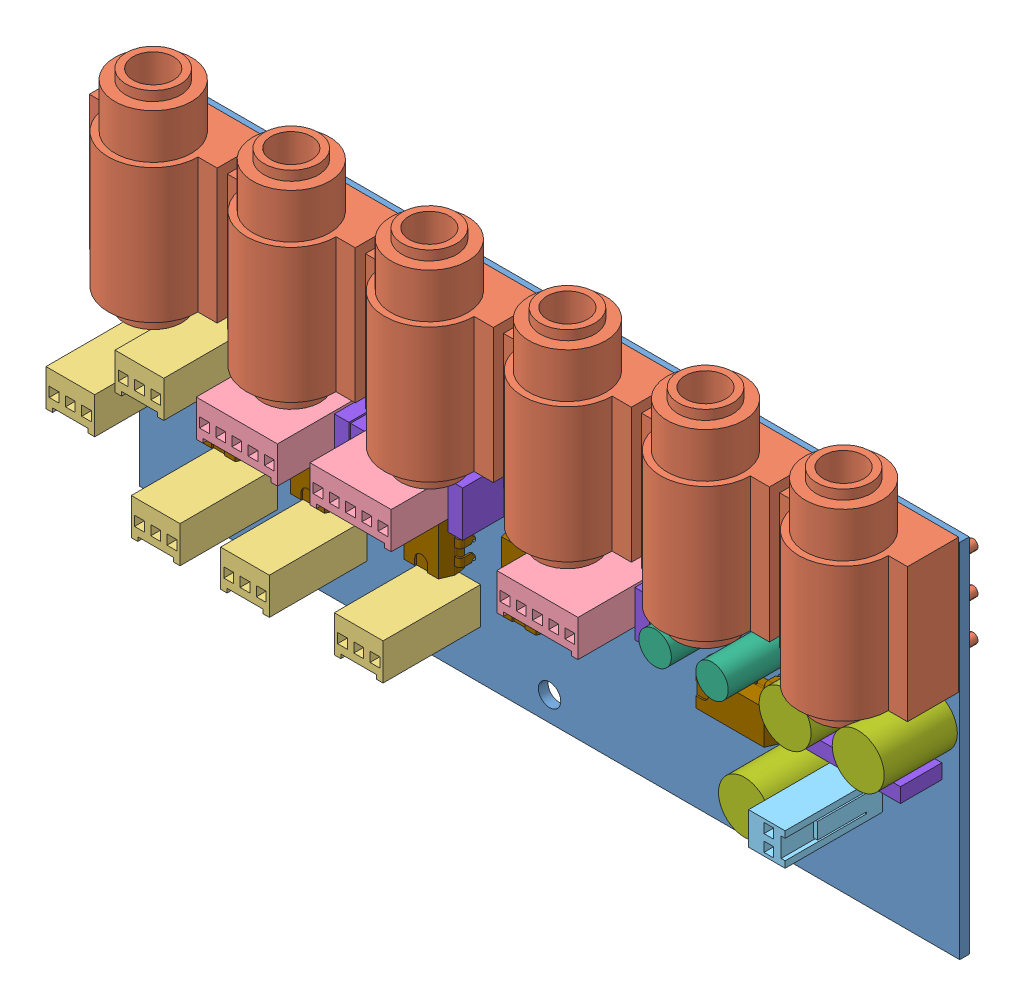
SolidWorks assembly Mix.SLDASM, configuration Default (file format 4400). Lengths in mm.
Overall size (128.27 65.65 19.24).
35 component instances, 9 part files, 107 mates.
Components (placement in the parent):
- Mixbrd-1: Mixbrd.SLDPRT [Default] at (-53.2181 34.2951 4.7829) size (128.27 56.52 1.5)
- nys216-1: nys216.SLDPRT [По умолчанию] at (-43.0581 34.9301 12.7829) x (1 0 0) z (0 1 0) size (20 19 32.5)
- nys216-2: nys216.SLDPRT [По умолчанию] at (-21.4681 34.9301 12.7829) x (1 0 0) z (0 1 0) size (20 19 32.5)
- nys216-3: nys216.SLDPRT [По умолчанию] at (0.1219 34.9301 12.7829) x (1 0 0) z (0 1 0) size (20 19 32.5)
- nys216-4: nys216.SLDPRT [По умолчанию] at (21.7119 34.9301 12.7829) x (1 0 0) z (0 1 0) size (20 19 32.5)
- nys216-5: nys216.SLDPRT [По умолчанию] at (43.3019 34.9301 12.7829) x (1 0 0) z (0 1 0) size (20 19 32.5)
- nys216-6: nys216.SLDPRT [По умолчанию] at (64.8919 34.9301 12.7829) x (1 0 0) z (0 1 0) size (20 19 32.5)
- WF3-1: WF3.SLDPRT [Default] at (-51.3131 -1.2649 4.7829) size (7.62 5.72 17.78)
- WF3-2: WF3.SLDPRT [Default] at (-37.9781 -12.0599 4.7829) size (7.62 5.72 17.78)
- WF3-3: WF3.SLDPRT [Default] at (-24.0081 -12.0599 4.7829) size (7.62 5.72 17.78)
- WF3-4: WF3.SLDPRT [Default] at (-6.2281 -12.0599 4.7829) size (7.62 5.72 17.78)
- WF5-1: WF5.SLDPRT [Default] at (-27.8181 6.3551 4.7829) size (12.7 5.72 17.78)
- WF5-2: WF5.SLDPRT [Default] at (-10.0381 6.3551 4.7829) size (12.7 5.72 17.78)
- WF5-3: WF5.SLDPRT [Default] at (19.1719 6.3551 4.7829) size (12.7 5.72 17.78)
- WF3-5: WF3.SLDPRT [Default] at (-40.5181 6.3551 4.7829) size (7.62 5.72 17.78)
- WF2-1: WF2.SLDPRT [Default] at (60.4469 -6.9799 4.7829) x (0 1 0) z (0 0 1) size (5.08 5.72 17.78)
- elco11_5X5-1: elco11_5X5.SLDPRT [По умолчанию] at (38.8569 7.6251 4.7829) x (0 -1 0) z (0 0 1) size (5.08 5.08 13.97)
- elco11_5X5-2: elco11_5X5.SLDPRT [По умолчанию] at (47.7469 7.6251 4.7829) x (0 -1 0) z (0 0 1) size (5.08 5.08 13.97)
- elco11_5X8_2-1: elco11_5X8_2.SLDPRT [По умолчанию] at (59.1769 8.2601 4.7829) size (8.13 8.13 13.97)
- elco11_5X8_2-2: elco11_5X8_2.SLDPRT [По умолчанию] at (70.6069 8.2601 4.7829) size (8.13 8.13 13.97)
- elco11_5X8_2-3: elco11_5X8_2.SLDPRT [По умолчанию] at (52.8269 -6.9799 4.7829) size (8.13 8.13 13.97)
- crm7_5X7_5X2_5X5-2: crm7_5X7_5X2_5X5.SLDPRT [Default] at (2.6619 5.7201 4.7829) x (0 -1 0) z (0 0 1) size (7.11 2.29 9.02)
- crm7_5X7_5X2_5X5-3: crm7_5X7_5X2_5X5.SLDPRT [Default] at (-43.0581 5.7201 4.7829) x (0 -1 0) z (0 0 1) size (7.11 2.29 9.02)
- crm7_5X7_5X2_5X5-4: crm7_5X7_5X2_5X5.SLDPRT [Default] at (-30.3581 5.7201 4.7829) x (0 -1 0) z (0 0 1) size (7.11 2.29 9.02)
- crm7_5X7_5X2_5X5-5: crm7_5X7_5X2_5X5.SLDPRT [Default] at (-15.1181 5.7201 4.7829) x (0 -1 0) z (0 0 1) size (7.11 2.29 9.02)
- crm7_5X7_5X2_5X5-6: crm7_5X7_5X2_5X5.SLDPRT [Default] at (-12.5781 5.7201 4.7829) x (0 -1 0) z (0 0 1) size (7.11 2.29 9.02)
- crm7_5X7_5X2_5X5-7: crm7_5X7_5X2_5X5.SLDPRT [Default] at (16.6319 5.7201 4.7829) x (0 -1 0) z (0 0 1) size (7.11 2.29 9.02)
- crm7_5X7_5X2_5X5-8: crm7_5X7_5X2_5X5.SLDPRT [Default] at (31.8719 5.7201 4.7829) x (0 -1 0) z (0 0 1) size (7.11 2.29 9.02)
- crm7_5X7_5X2_5X5-9: crm7_5X7_5X2_5X5.SLDPRT [Default] at (61.0819 1.9101 4.7829) x (-1 0 0) z (0 0 1) size (7.11 2.29 9.02)
- crm7_5X7_5X2_5X5-10: crm7_5X7_5X2_5X5.SLDPRT [Default] at (68.7019 1.9101 4.7829) x (-1 0 0) z (0 0 1) size (7.11 2.29 9.02)
- dip8-1: dip8.SLDPRT [Default] at (39.4919 -5.7099 4.7829) x (0 1 0) z (1 0 0) size (8.38 6.86 11.43)
- dip8-2: dip8.SLDPRT [Default] at (14.0919 -5.7099 4.7829) x (-1 0 0) z (0 1 0) size (8.38 6.86 11.43)
- dip8-3: dip8.SLDPRT [Default] at (-1.1481 -5.7099 4.7829) x (-1 0 0) z (0 1 0) size (8.38 6.86 11.43)
- dip8-4: dip8.SLDPRT [Default] at (-18.9281 -5.7099 4.7829) x (-1 0 0) z (0 1 0) size (8.38 6.86 11.43)
- dip8-5: dip8.SLDPRT [Default] at (-32.8981 -5.7099 4.7829) x (-1 0 0) z (0 1 0) size (8.38 6.86 11.43)
Mates (geometry in assembly coordinates):
- Concentric1: concentric anti-aligned: circle of Mixbrd-1; circle of nys216-1
- Concentric2: concentric anti-aligned: circle of Mixbrd-1; circle of nys216-1
- Coincident1: coincident anti-aligned: plane of Mixbrd-1 through (-53.2181 -22.2199 4.7829) normal (0 0 1); plane of nys216-1 through (-33.0581 13.9301 4.7829) normal (0 0 -1)
- Concentric3: concentric anti-aligned: circle of Mixbrd-1; circle of nys216-2
- Concentric4: concentric anti-aligned: circle of Mixbrd-1; circle of nys216-2
- Coincident2: coincident anti-aligned: plane of Mixbrd-1 through (-53.2181 -22.2199 4.7829) normal (0 0 1); plane of nys216-2 through (-11.4681 13.9301 4.7829) normal (0 0 -1)
- Concentric5: concentric anti-aligned: circle of Mixbrd-1; circle of nys216-3
- Concentric6: concentric anti-aligned: circle of Mixbrd-1; circle of nys216-3
- Coincident3: coincident anti-aligned: plane of Mixbrd-1 through (-53.2181 -22.2199 4.7829) normal (0 0 1); plane of nys216-3 through (10.1219 13.9301 4.7829) normal (0 0 -1)
- Concentric7: concentric anti-aligned: circle of Mixbrd-1; circle of nys216-4
- Concentric8: concentric anti-aligned: circle of Mixbrd-1; circle of nys216-4
- Coincident4: coincident anti-aligned: plane of Mixbrd-1 through (-53.2181 -22.2199 4.7829) normal (0 0 1); plane of nys216-4 through (31.7119 13.9301 4.7829) normal (0 0 -1)
- Concentric9: concentric anti-aligned: circle of Mixbrd-1; circle of nys216-5
- Concentric10: concentric anti-aligned: circle of Mixbrd-1; circle of nys216-5
- Coincident5: coincident anti-aligned: plane of Mixbrd-1 through (-53.2181 -22.2199 4.7829) normal (0 0 1); plane of nys216-5 through (53.3019 13.9301 4.7829) normal (0 0 -1)
- Concentric11: concentric anti-aligned: circle of Mixbrd-1; circle of nys216-6
- Concentric12: concentric anti-aligned: circle of Mixbrd-1; circle of nys216-6
- Coincident6: coincident anti-aligned: plane of Mixbrd-1 through (-53.2181 -22.2199 4.7829) normal (0 0 1); plane of nys216-6 through (74.8919 13.9301 4.7829) normal (0 0 -1)
- Concentric13: concentric anti-aligned: circle of Mixbrd-1; circle of WF3-1
- Concentric14: concentric anti-aligned: circle of Mixbrd-1; circle of WF3-1
- Coincident7: coincident anti-aligned: plane of Mixbrd-1 through (-53.2181 -22.2199 4.7829) normal (0 0 1); plane of WF3-1 through (-52.5831 -3.8049 4.7829) normal (0 0 -1)
- Concentric15: concentric anti-aligned: circle of Mixbrd-1; circle of WF3-2
- Concentric16: concentric anti-aligned: circle of Mixbrd-1; circle of WF3-2
- Coincident8: coincident anti-aligned: plane of Mixbrd-1 through (-53.2181 -22.2199 4.7829) normal (0 0 1); plane of WF3-2 through (-39.2481 -14.5999 4.7829) normal (0 0 -1)
- Concentric17: concentric anti-aligned: circle of Mixbrd-1; circle of WF3-3
- Concentric18: concentric anti-aligned: circle of Mixbrd-1; circle of WF3-3
- Coincident9: coincident anti-aligned: plane of Mixbrd-1 through (-53.2181 -22.2199 4.7829) normal (0 0 1); plane of WF3-3 through (-25.2781 -14.5999 4.7829) normal (0 0 -1)
- Concentric19: concentric anti-aligned: circle of Mixbrd-1; circle of WF3-4
- Concentric20: concentric anti-aligned: circle of Mixbrd-1; circle of WF3-4
- Coincident10: coincident anti-aligned: plane of Mixbrd-1 through (-53.2181 -22.2199 4.7829) normal (0 0 1); plane of WF3-4 through (-7.4981 -14.5999 4.7829) normal (0 0 -1)
- Concentric21: concentric anti-aligned: circle of Mixbrd-1; circle of WF5-1
- Concentric22: concentric anti-aligned: circle of Mixbrd-1; circle of WF5-1
- Coincident11: coincident anti-aligned: plane of Mixbrd-1 through (-53.2181 -22.2199 4.7829) normal (0 0 1); plane of WF5-1 through (-29.0881 3.8151 4.7829) normal (0 0 -1)
- Concentric23: concentric anti-aligned: circle of Mixbrd-1; circle of WF5-2
- Concentric24: concentric anti-aligned: circle of Mixbrd-1; circle of WF5-2
- Coincident12: coincident anti-aligned: plane of Mixbrd-1 through (-53.2181 -22.2199 4.7829) normal (0 0 1); plane of WF5-2 through (-11.3081 3.8151 4.7829) normal (0 0 -1)
- Concentric25: concentric anti-aligned: circle of Mixbrd-1; circle of WF5-3
- Concentric26: concentric anti-aligned: circle of Mixbrd-1; circle of WF5-3
- Coincident13: coincident anti-aligned: plane of Mixbrd-1 through (-53.2181 -22.2199 4.7829) normal (0 0 1); plane of WF5-3 through (17.9019 3.8151 4.7829) normal (0 0 -1)
- Concentric27: concentric anti-aligned: circle of Mixbrd-1; circle of WF3-5
- Concentric28: concentric anti-aligned: circle of Mixbrd-1; circle of WF3-5
- Coincident14: coincident anti-aligned: plane of Mixbrd-1 through (-53.2181 -22.2199 4.7829) normal (0 0 1); plane of WF3-5 through (-41.7881 3.8151 4.7829) normal (0 0 -1)
- Concentric29: concentric anti-aligned: circle of Mixbrd-1; circle of WF2-1
- Concentric30: concentric anti-aligned: circle of Mixbrd-1; circle of WF2-1
- Coincident15: coincident anti-aligned: plane of Mixbrd-1 through (-53.2181 -22.2199 4.7829) normal (0 0 1); plane of WF2-1 through (62.9869 -8.2499 4.7829) normal (0 0 -1)
- Concentric33: concentric anti-aligned: circle of Mixbrd-1; circle of elco11_5X5-1
- Concentric34: concentric anti-aligned: circle of Mixbrd-1; circle of elco11_5X5-1
- Coincident17: coincident anti-aligned: plane of Mixbrd-1 through (-53.2181 -22.2199 4.7829) normal (0 0 1); plane of elco11_5X5-1 through (38.8569 7.6251 4.7829) normal (0 0 -1)
- Concentric35: concentric anti-aligned: circle of Mixbrd-1; circle of elco11_5X5-2
- Concentric36: concentric anti-aligned: circle of Mixbrd-1; circle of elco11_5X5-2
- Coincident18: coincident anti-aligned: plane of Mixbrd-1 through (-53.2181 -22.2199 4.7829) normal (0 0 1); plane of elco11_5X5-2 through (47.7469 7.6251 4.7829) normal (0 0 -1)
- Concentric37: concentric anti-aligned: circle of Mixbrd-1; circle of elco11_5X8_2-1
- Concentric38: concentric anti-aligned: circle of Mixbrd-1; circle of elco11_5X8_2-1
- Coincident20: coincident anti-aligned: plane of Mixbrd-1 through (-53.2181 -22.2199 4.7829) normal (0 0 1); plane of elco11_5X8_2-1 through (59.1769 8.2601 4.7829) normal (0 0 -1)
- Concentric39: concentric anti-aligned: circle of Mixbrd-1; circle of elco11_5X8_2-2
- Concentric40: concentric anti-aligned: circle of Mixbrd-1; circle of elco11_5X8_2-2
- Coincident21: coincident anti-aligned: plane of Mixbrd-1 through (-53.2181 -22.2199 4.7829) normal (0 0 1); plane of elco11_5X8_2-2 through (70.6069 8.2601 4.7829) normal (0 0 -1)
- Concentric41: concentric anti-aligned: circle of Mixbrd-1; circle of elco11_5X8_2-3
- Concentric42: concentric anti-aligned: circle of Mixbrd-1; circle of elco11_5X8_2-3
- Coincident22: coincident anti-aligned: plane of Mixbrd-1 through (-53.2181 -22.2199 4.7829) normal (0 0 1); plane of elco11_5X8_2-3 through (52.8269 -6.9799 4.7829) normal (0 0 -1)
- Concentric47: concentric anti-aligned: circle of Mixbrd-1; circle of crm7_5X7_5X2_5X5-2
- Concentric48: concentric anti-aligned: circle of Mixbrd-1; circle of crm7_5X7_5X2_5X5-2
- Coincident23: coincident anti-aligned: plane of Mixbrd-1 through (-53.2181 -22.2199 4.7829) normal (0 0 1); plane of crm7_5X7_5X2_5X5-2 through (1.5189 9.2761 4.7829) normal (0 0 -1)
- Concentric49: concentric anti-aligned: circle of Mixbrd-1; circle of crm7_5X7_5X2_5X5-3
- Concentric50: concentric anti-aligned: circle of Mixbrd-1; circle of crm7_5X7_5X2_5X5-3
- Coincident24: coincident anti-aligned: plane of Mixbrd-1 through (-53.2181 -22.2199 4.7829) normal (0 0 1); plane of crm7_5X7_5X2_5X5-3 through (-44.2011 9.2761 4.7829) normal (0 0 -1)
- Concentric51: concentric anti-aligned: circle of Mixbrd-1; circle of crm7_5X7_5X2_5X5-4
- Concentric52: concentric anti-aligned: circle of Mixbrd-1; circle of crm7_5X7_5X2_5X5-4
- Coincident25: coincident anti-aligned: plane of Mixbrd-1 through (-53.2181 -22.2199 4.7829) normal (0 0 1); plane of crm7_5X7_5X2_5X5-4 through (-31.5011 9.2761 4.7829) normal (0 0 -1)
- Concentric53: concentric anti-aligned: circle of Mixbrd-1; circle of crm7_5X7_5X2_5X5-5
- Concentric54: concentric anti-aligned: circle of Mixbrd-1; circle of crm7_5X7_5X2_5X5-5
- Coincident26: coincident anti-aligned: plane of Mixbrd-1 through (-53.2181 -22.2199 4.7829) normal (0 0 1); plane of crm7_5X7_5X2_5X5-5 through (-16.2611 9.2761 4.7829) normal (0 0 -1)
- Concentric55: concentric anti-aligned: circle of Mixbrd-1; circle of crm7_5X7_5X2_5X5-6
- Concentric56: concentric anti-aligned: circle of Mixbrd-1; circle of crm7_5X7_5X2_5X5-6
- Coincident27: coincident anti-aligned: plane of Mixbrd-1 through (-53.2181 -22.2199 4.7829) normal (0 0 1); plane of crm7_5X7_5X2_5X5-6 through (-13.7211 9.2761 4.7829) normal (0 0 -1)
- Concentric57: concentric anti-aligned: circle of Mixbrd-1; circle of crm7_5X7_5X2_5X5-7
- Concentric58: concentric anti-aligned: circle of Mixbrd-1; circle of crm7_5X7_5X2_5X5-7
- Coincident28: coincident anti-aligned: plane of Mixbrd-1 through (-53.2181 -22.2199 4.7829) normal (0 0 1); plane of crm7_5X7_5X2_5X5-7 through (15.4889 9.2761 4.7829) normal (0 0 -1)
- Concentric59: concentric anti-aligned: circle of Mixbrd-1; circle of crm7_5X7_5X2_5X5-8
- Concentric60: concentric anti-aligned: circle of Mixbrd-1; circle of crm7_5X7_5X2_5X5-8
- Coincident29: coincident anti-aligned: plane of Mixbrd-1 through (-53.2181 -22.2199 4.7829) normal (0 0 1); plane of crm7_5X7_5X2_5X5-8 through (30.7289 9.2761 4.7829) normal (0 0 -1)
- Concentric61: concentric anti-aligned: circle of Mixbrd-1; circle of crm7_5X7_5X2_5X5-9
- Concentric62: concentric anti-aligned: circle of Mixbrd-1; circle of crm7_5X7_5X2_5X5-9
- Coincident30: coincident anti-aligned: plane of Mixbrd-1 through (-53.2181 -22.2199 4.7829) normal (0 0 1); plane of crm7_5X7_5X2_5X5-9 through (64.6379 3.0531 4.7829) normal (0 0 -1)
- Concentric63: concentric anti-aligned: circle of Mixbrd-1; circle of crm7_5X7_5X2_5X5-10
- Concentric64: concentric anti-aligned: circle of Mixbrd-1; circle of crm7_5X7_5X2_5X5-10
- Coincident31: coincident anti-aligned: plane of Mixbrd-1 through (-53.2181 -22.2199 4.7829) normal (0 0 1); plane of crm7_5X7_5X2_5X5-10 through (72.2579 3.0531 4.7829) normal (0 0 -1)
- Coincident34: coincident aligned: plane of Mixbrd-1 through (-53.2181 -22.2199 4.7829) normal (0 0 1); circle of dip8-1
- Coincident35: coincident aligned: plane of Mixbrd-1 through (-53.2181 -22.2199 4.7829) normal (0 0 1); circle of dip8-1
- Concentric67: concentric aligned: circle of Mixbrd-1; circle of dip8-1
- Concentric68: concentric aligned: circle of Mixbrd-1; circle of dip8-1
- Coincident37: coincident aligned: plane of Mixbrd-1 through (-53.2181 -22.2199 4.7829) normal (0 0 1); circle of dip8-2
- Coincident38: coincident aligned: plane of Mixbrd-1 through (-53.2181 -22.2199 4.7829) normal (0 0 1); circle of dip8-2
- Concentric69: concentric aligned: circle of Mixbrd-1; circle of dip8-2
- Concentric70: concentric aligned: circle of Mixbrd-1; circle of dip8-2
- Coincident39: coincident aligned: plane of Mixbrd-1 through (-53.2181 -22.2199 4.7829) normal (0 0 1); circle of dip8-3
- Coincident40: coincident aligned: plane of Mixbrd-1 through (-53.2181 -22.2199 4.7829) normal (0 0 1); circle of dip8-3
- Concentric71: concentric aligned: circle of Mixbrd-1; circle of dip8-3
- Concentric72: concentric aligned: circle of Mixbrd-1; circle of dip8-3
- Coincident41: coincident aligned: plane of Mixbrd-1 through (-53.2181 -22.2199 4.7829) normal (0 0 1); circle of dip8-4
- Coincident42: coincident aligned: plane of Mixbrd-1 through (-53.2181 -22.2199 4.7829) normal (0 0 1); circle of dip8-4
- Concentric73: concentric aligned: circle of Mixbrd-1; circle of dip8-4
- Concentric74: concentric aligned: circle of Mixbrd-1; circle of dip8-4
- Coincident43: coincident aligned: plane of Mixbrd-1 through (-53.2181 -22.2199 4.7829) normal (0 0 1); circle of dip8-5
- Coincident44: coincident aligned: plane of Mixbrd-1 through (-53.2181 -22.2199 4.7829) normal (0 0 1); circle of dip8-5
- Concentric75: concentric aligned: circle of Mixbrd-1; circle of dip8-5
- Concentric76: concentric aligned: circle of Mixbrd-1; circle of dip8-5
